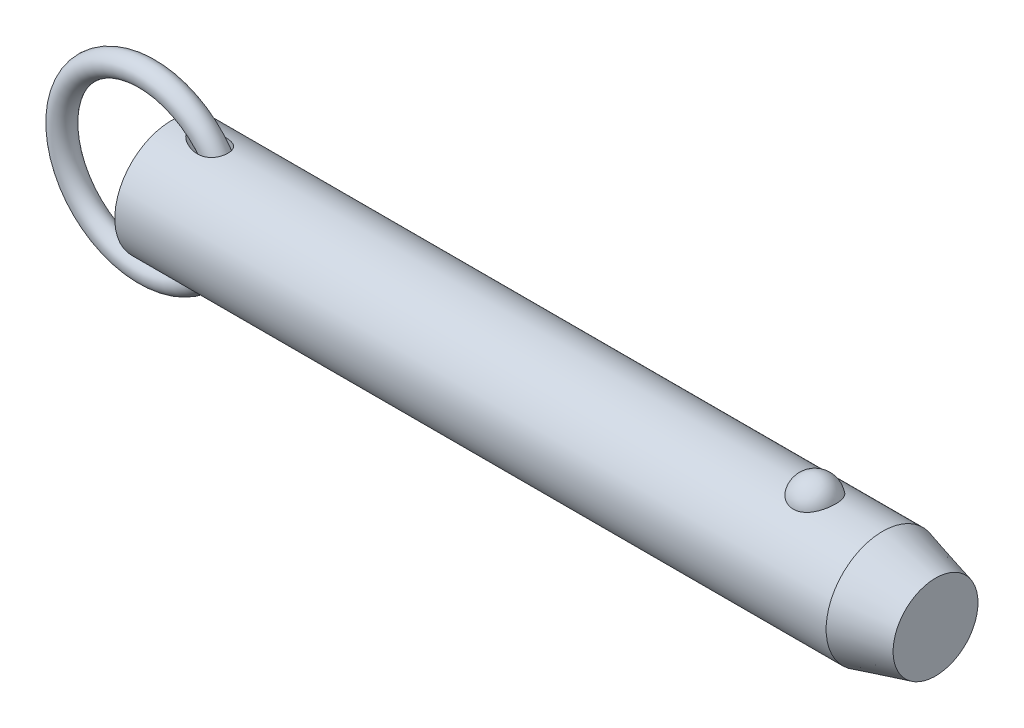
ISO-10303-21;
HEADER;
FILE_DESCRIPTION(('STEP AP214'),'2;1');
FILE_NAME('part.step','',(''),(''),'','','');
FILE_SCHEMA(('AUTOMOTIVE_DESIGN { 1 0 10303 214 1 1 1 1 }'));
ENDSEC;
DATA;
#1=APPLICATION_CONTEXT('core data for automotive mechanical design processes');
#2=APPLICATION_PROTOCOL_DEFINITION('international standard','automotive_design',2000,#1);
#3=PRODUCT_CONTEXT('',#1,'mechanical');
#4=PRODUCT('Part','Part','',(#3));
#5=PRODUCT_RELATED_PRODUCT_CATEGORY('part','',(#4));
#6=PRODUCT_DEFINITION_FORMATION('','',#4);
#7=PRODUCT_DEFINITION_CONTEXT('part definition',#1,'design');
#8=PRODUCT_DEFINITION('design','',#6,#7);
#9=PRODUCT_DEFINITION_SHAPE('','',#8);
#10=(LENGTH_UNIT() NAMED_UNIT(*) SI_UNIT(.MILLI.,.METRE.));
#11=(NAMED_UNIT(*) PLANE_ANGLE_UNIT() SI_UNIT($,.RADIAN.));
#12=(NAMED_UNIT(*) SI_UNIT($,.STERADIAN.) SOLID_ANGLE_UNIT());
#13=UNCERTAINTY_MEASURE_WITH_UNIT(LENGTH_MEASURE(1.E-05),#10,'distance_accuracy_value','');
#14=(GEOMETRIC_REPRESENTATION_CONTEXT(3) GLOBAL_UNCERTAINTY_ASSIGNED_CONTEXT((#13)) GLOBAL_UNIT_ASSIGNED_CONTEXT((#10,
#11,#12)) REPRESENTATION_CONTEXT('',''));
#15=CARTESIAN_POINT('',(0.,0.,0.));
#16=DIRECTION('',(0.,0.,1.));
#17=DIRECTION('',(1.,0.,0.));
#18=AXIS2_PLACEMENT_3D('',#15,#16,#17);
#19=CARTESIAN_POINT('',(-5.53898640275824,0.,0.));
#20=DIRECTION('',(0.,0.,1.));
#21=DIRECTION('',(1.,0.,0.));
#22=AXIS2_PLACEMENT_3D('',#19,#20,#21);
#23=TOROIDAL_SURFACE('',#22,19.05,2.54);
#24=CARTESIAN_POINT('',(16.0510135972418,0.,0.));
#25=VERTEX_POINT('',#24);
#26=VERTEX_LOOP('',#25);
#27=FACE_BOUND('',#26,.T.);
#28=ADVANCED_FACE('P0_F12',(#27),#23,.T.);
#29=CLOSED_SHELL('',(#28));
#30=MANIFOLD_SOLID_BREP('P0_B1',#29);
#31=CARTESIAN_POINT('',(0.,0.,0.));
#32=DIRECTION('',(1.,0.,0.));
#33=DIRECTION('',(0.,0.,-1.));
#34=AXIS2_PLACEMENT_3D('',#31,#32,#33);
#35=CYLINDRICAL_SURFACE('',#34,12.7);
#36=CARTESIAN_POINT('',(159.600738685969,0.,0.));
#37=DIRECTION('',(1.,0.,0.));
#38=DIRECTION('',(0.,0.,-1.));
#39=AXIS2_PLACEMENT_3D('',#36,#37,#38);
#40=CIRCLE('',#39,12.7);
#41=CARTESIAN_POINT('',(159.600738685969,0.,-12.7));
#42=VERTEX_POINT('',#41);
#43=EDGE_CURVE('P1_E89',#42,#42,#40,.T.);
#44=ORIENTED_EDGE('',*,*,#43,.F.);
#45=EDGE_LOOP('',(#44));
#46=FACE_BOUND('',#45,.T.);
#47=CARTESIAN_POINT('',(0.,0.,0.));
#48=DIRECTION('',(1.,0.,0.));
#49=DIRECTION('',(0.,0.,-1.));
#50=AXIS2_PLACEMENT_3D('',#47,#48,#49);
#51=CIRCLE('',#50,12.7);
#52=CARTESIAN_POINT('',(0.,0.,-12.7));
#53=VERTEX_POINT('',#52);
#54=EDGE_CURVE('P1_E52',#53,#53,#51,.T.);
#55=ORIENTED_EDGE('',*,*,#54,.T.);
#56=EDGE_LOOP('',(#55));
#57=FACE_BOUND('',#56,.T.);
#58=CARTESIAN_POINT('',(144.360042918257,11.7500437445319,4.81938502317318));
#59=CARTESIAN_POINT('',(144.235088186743,11.7500430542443,4.81938571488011));
#60=CARTESIAN_POINT('',(144.110144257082,11.7520975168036,4.81438658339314));
#61=CARTESIAN_POINT('',(143.861142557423,11.760253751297,4.79442904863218));
#62=CARTESIAN_POINT('',(143.737085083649,11.7663568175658,4.77946746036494));
#63=CARTESIAN_POINT('',(143.490901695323,11.7824262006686,4.7397141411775));
#64=CARTESIAN_POINT('',(143.368774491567,11.7923898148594,4.71492928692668));
#65=CARTESIAN_POINT('',(143.127187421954,11.8158938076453,4.65571340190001));
#66=CARTESIAN_POINT('',(143.00772859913,11.8294355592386,4.6212786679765));
#67=CARTESIAN_POINT('',(142.772557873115,11.8596812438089,4.54309502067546));
#68=CARTESIAN_POINT('',(142.656839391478,11.8763792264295,4.49936361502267));
#69=CARTESIAN_POINT('',(142.429653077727,11.9124878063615,4.40287235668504));
#70=CARTESIAN_POINT('',(142.318186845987,11.9318994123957,4.35010914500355));
#71=CARTESIAN_POINT('',(141.991278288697,11.9934256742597,4.17881316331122));
#72=CARTESIAN_POINT('',(141.783127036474,12.038858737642,4.04720756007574));
#73=CARTESIAN_POINT('',(141.385850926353,12.1352173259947,3.748564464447));
#74=CARTESIAN_POINT('',(141.197443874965,12.1862630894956,3.58061821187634));
#75=CARTESIAN_POINT('',(140.850521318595,12.2875163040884,3.21600758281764));
#76=CARTESIAN_POINT('',(140.692011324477,12.3377235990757,3.0193379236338));
#77=CARTESIAN_POINT('',(140.40168878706,12.4344923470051,2.592916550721));
#78=CARTESIAN_POINT('',(140.271376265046,12.4807925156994,2.36208286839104));
#79=CARTESIAN_POINT('',(140.049407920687,12.5623454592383,1.88070399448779));
#80=CARTESIAN_POINT('',(139.957755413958,12.5975972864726,1.63015711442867));
#81=CARTESIAN_POINT('',(139.814046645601,12.6538414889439,1.1129886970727));
#82=CARTESIAN_POINT('',(139.762499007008,12.6746503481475,0.846205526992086));
#83=CARTESIAN_POINT('',(139.701977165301,12.699153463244,0.307085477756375));
#84=CARTESIAN_POINT('',(139.693001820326,12.7028481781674,0.034748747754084));
#85=CARTESIAN_POINT('',(139.717731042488,12.6927785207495,-0.506073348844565));
#86=CARTESIAN_POINT('',(139.751189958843,12.6791146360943,-0.774571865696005));
#87=CARTESIAN_POINT('',(139.859687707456,12.635882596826,-1.30170246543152));
#88=CARTESIAN_POINT('',(139.93472729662,12.606314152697,-1.56033436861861));
#89=CARTESIAN_POINT('',(140.12500006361,12.5342328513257,-2.0608389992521));
#90=CARTESIAN_POINT('',(140.240287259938,12.4917026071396,-2.30268867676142));
#91=CARTESIAN_POINT('',(140.508704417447,12.3981123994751,-2.76259600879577));
#92=CARTESIAN_POINT('',(140.661837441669,12.3470517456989,-2.98065173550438));
#93=CARTESIAN_POINT('',(141.003507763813,12.2416045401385,-3.38786328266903));
#94=CARTESIAN_POINT('',(141.192201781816,12.1872040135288,-3.57688418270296));
#95=CARTESIAN_POINT('',(141.600239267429,12.0814086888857,-3.91941073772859));
#96=CARTESIAN_POINT('',(141.819580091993,12.0300136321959,-4.07291945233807));
#97=CARTESIAN_POINT('',(142.278375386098,11.9373542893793,-4.33691289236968));
#98=CARTESIAN_POINT('',(142.517304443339,11.8958982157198,-4.44824125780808));
#99=CARTESIAN_POINT('',(143.01243761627,11.8268116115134,-4.62881985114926));
#100=CARTESIAN_POINT('',(143.268635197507,11.7991758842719,-4.69808589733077));
#101=CARTESIAN_POINT('',(143.777164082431,11.7622209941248,-4.78983181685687));
#102=CARTESIAN_POINT('',(144.029041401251,11.7520502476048,-4.81449025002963));
#103=CARTESIAN_POINT('',(144.533573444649,11.7485796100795,-4.82295735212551));
#104=CARTESIAN_POINT('',(144.786228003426,11.7552763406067,-4.80677420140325));
#105=CARTESIAN_POINT('',(145.276834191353,11.7842584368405,-4.73525430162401));
#106=CARTESIAN_POINT('',(145.514998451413,11.8060486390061,-4.68116061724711));
#107=CARTESIAN_POINT('',(145.978489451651,11.8622750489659,-4.53678133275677));
#108=CARTESIAN_POINT('',(146.203815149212,11.8967122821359,-4.44649279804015));
#109=CARTESIAN_POINT('',(146.640801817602,11.9754603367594,-4.22987613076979));
#110=CARTESIAN_POINT('',(146.852057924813,12.0199699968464,-4.10280539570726));
#111=CARTESIAN_POINT('',(147.250601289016,12.1138028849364,-3.81685409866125));
#112=CARTESIAN_POINT('',(147.437883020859,12.163127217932,-3.65796622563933));
#113=CARTESIAN_POINT('',(147.793350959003,12.2642343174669,-3.30364864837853));
#114=CARTESIAN_POINT('',(147.960111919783,12.3160165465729,-3.10678783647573));
#115=CARTESIAN_POINT('',(148.259579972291,12.4142566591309,-2.68748409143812));
#116=CARTESIAN_POINT('',(148.392280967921,12.4607135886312,-2.4650365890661));
#117=CARTESIAN_POINT('',(148.624691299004,12.5450236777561,-1.9928951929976));
#118=CARTESIAN_POINT('',(148.723215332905,12.5825557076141,-1.74255918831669));
#119=CARTESIAN_POINT('',(148.879227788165,12.6431720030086,-1.2277373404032));
#120=CARTESIAN_POINT('',(148.936715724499,12.6662560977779,-0.96325132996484));
#121=CARTESIAN_POINT('',(149.009544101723,12.6956486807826,-0.4273550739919));
#122=CARTESIAN_POINT('',(149.024837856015,12.7019385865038,-0.155937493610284));
#123=CARTESIAN_POINT('',(149.012779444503,12.6970201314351,0.385928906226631));
#124=CARTESIAN_POINT('',(148.98542805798,12.6858120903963,0.656377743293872));
#125=CARTESIAN_POINT('',(148.913060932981,12.6568455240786,1.05454017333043));
#126=CARTESIAN_POINT('',(148.883796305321,12.6451962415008,1.185778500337));
#127=CARTESIAN_POINT('',(148.815022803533,12.6181819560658,1.44513808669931));
#128=CARTESIAN_POINT('',(148.775517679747,12.6028183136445,1.57326046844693));
#129=CARTESIAN_POINT('',(148.686439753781,12.5687547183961,1.82554978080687));
#130=CARTESIAN_POINT('',(148.636862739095,12.5500533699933,1.9497150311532));
#131=CARTESIAN_POINT('',(148.52792115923,12.5098093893,2.19314370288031));
#132=CARTESIAN_POINT('',(148.468560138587,12.4882677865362,2.31240887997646));
#133=CARTESIAN_POINT('',(148.33997128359,12.4427679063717,2.5459303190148));
#134=CARTESIAN_POINT('',(148.270688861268,12.4187964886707,2.66015396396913));
#135=CARTESIAN_POINT('',(148.122903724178,12.3691892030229,2.88202659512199));
#136=CARTESIAN_POINT('',(148.044404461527,12.3435539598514,2.98967802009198));
#137=CARTESIAN_POINT('',(147.878550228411,12.2912955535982,3.1977438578));
#138=CARTESIAN_POINT('',(147.791191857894,12.2646720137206,3.29815546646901));
#139=CARTESIAN_POINT('',(147.608161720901,12.2111945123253,3.49095035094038));
#140=CARTESIAN_POINT('',(147.512493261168,12.1843406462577,3.58333679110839));
#141=CARTESIAN_POINT('',(147.313627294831,12.1312249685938,3.7592287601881));
#142=CARTESIAN_POINT('',(147.210450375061,12.104961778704,3.84275713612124));
#143=CARTESIAN_POINT('',(146.99701336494,12.0537284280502,4.00056406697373));
#144=CARTESIAN_POINT('',(146.886756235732,12.028757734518,4.07484645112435));
#145=CARTESIAN_POINT('',(146.659755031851,11.9808306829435,4.21367959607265));
#146=CARTESIAN_POINT('',(146.543006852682,11.9578756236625,4.27822410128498));
#147=CARTESIAN_POINT('',(146.30394258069,11.9147184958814,4.39698483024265));
#148=CARTESIAN_POINT('',(146.181628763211,11.894515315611,4.45120522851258));
#149=CARTESIAN_POINT('',(145.922952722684,11.8561129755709,4.55255353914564));
#150=CARTESIAN_POINT('',(145.786223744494,11.8381764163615,4.59884858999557));
#151=CARTESIAN_POINT('',(145.508608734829,11.8069093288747,4.67853897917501));
#152=CARTESIAN_POINT('',(145.367724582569,11.7935767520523,4.71194005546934));
#153=CARTESIAN_POINT('',(145.08309446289,11.7720277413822,4.76552188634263));
#154=CARTESIAN_POINT('',(144.939348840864,11.7638106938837,4.78570422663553));
#155=CARTESIAN_POINT('',(144.650411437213,11.7528195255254,4.81263433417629));
#156=CARTESIAN_POINT('',(144.505219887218,11.7500445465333,4.81938421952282));
#157=CARTESIAN_POINT('',(144.360042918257,11.7500437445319,4.81938502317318));
#158=B_SPLINE_CURVE_WITH_KNOTS('',3,(#58,#59,#60,#61,#62,#63,#64,#65,#66,#67,#68,#69,#70,#71,
#72,#73,#74,#75,#76,#77,#78,#79,#80,#81,#82,#83,#84,#85,#86,#87,#88,#89,#90,#91,#92,#93,#94,#95,
#96,#97,#98,#99,#100,#101,#102,#103,#104,#105,#106,#107,#108,#109,#110,#111,#112,#113,#114,#115,
#116,#117,#118,#119,#120,#121,#122,#123,#124,#125,#126,#127,#128,#129,#130,#131,#132,#133,#134,
#135,#136,#137,#138,#139,#140,#141,#142,#143,#144,#145,#146,#147,#148,#149,#150,#151,#152,#153,
#154,#155,#156,#157),.UNSPECIFIED.,.T.,.F.,(4,2,2,2,2,2,2,2,2,2,2,2,2,2,2,2,2,2,2,2,2,2,2,2,2,2,
2,2,2,2,2,2,2,2,2,2,2,2,2,2,2,2,2,2,2,2,2,2,2,4),(0.,0.374729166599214,0.749578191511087,
1.12416526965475,1.49889629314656,1.87292776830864,2.24709865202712,2.99481328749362,
3.76399449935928,4.53331735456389,5.3368391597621,6.14042986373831,6.95405296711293,
7.76765424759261,8.57656703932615,9.38549455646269,10.1955119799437,11.0055949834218,
11.8193353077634,12.6330054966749,13.4294141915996,14.2255231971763,14.9815786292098,
15.7374826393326,16.4696948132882,17.2019663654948,17.9501979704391,18.6986017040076,
19.4844704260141,20.2704797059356,21.0815215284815,21.8925729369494,22.7045213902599,
23.5164550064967,23.9209608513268,24.3253187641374,24.7298461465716,25.1342272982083,
25.54092555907,25.9474719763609,26.3541750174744,26.7607169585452,27.1661834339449,
27.5714814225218,27.9770386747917,28.3824315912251,28.818120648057,29.2536155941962,
29.6890582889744,30.1244323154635),.UNSPECIFIED.);
#159=CARTESIAN_POINT('',(144.360042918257,11.7500437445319,4.81938502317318));
#160=VERTEX_POINT('',#159);
#161=EDGE_CURVE('P1_E80',#160,#160,#158,.T.);
#162=ORIENTED_EDGE('',*,*,#161,.T.);
#163=EDGE_LOOP('',(#162));
#164=FACE_BOUND('',#163,.T.);
#165=CARTESIAN_POINT('',(-5.53898640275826,0.,0.));
#166=DIRECTION('',(0.796400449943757,-0.604769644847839,0.));
#167=DIRECTION('',(0.604769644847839,0.796400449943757,0.));
#168=AXIS2_PLACEMENT_3D('',#165,#166,#167);
#169=ELLIPSE('',#168,15.9467514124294,12.7);
#170=CARTESIAN_POINT('',(4.09482149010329,12.6864319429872,0.586893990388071));
#171=VERTEX_POINT('',#170);
#172=CARTESIAN_POINT('',(4.09482149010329,12.6864319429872,-0.586893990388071));
#173=VERTEX_POINT('',#172);
#174=EDGE_CURVE('P1_E47',#171,#173,#169,.F.);
#175=ORIENTED_EDGE('',*,*,#174,.T.);
#176=CARTESIAN_POINT('',(4.06153170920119,12.6905758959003,-0.48916605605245));
#177=CARTESIAN_POINT('',(4.0811137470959,12.6881366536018,-0.552489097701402));
#178=CARTESIAN_POINT('',(4.1041785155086,12.6852663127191,-0.614604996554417));
#179=CARTESIAN_POINT('',(4.15628434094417,12.6787965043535,-0.736067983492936));
#180=CARTESIAN_POINT('',(4.18531032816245,12.6751988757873,-0.795421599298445));
#181=CARTESIAN_POINT('',(4.27911159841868,12.6636052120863,-0.967590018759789));
#182=CARTESIAN_POINT('',(4.35123408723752,12.654730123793,-1.07635920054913));
#183=CARTESIAN_POINT('',(4.49106800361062,12.6376715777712,-1.25922957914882));
#184=CARTESIAN_POINT('',(4.55601066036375,12.6297947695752,-1.33556751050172));
#185=CARTESIAN_POINT('',(4.692236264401,12.6134116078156,-1.4823274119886));
#186=CARTESIAN_POINT('',(4.76352147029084,12.6049050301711,-1.55274725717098));
#187=CARTESIAN_POINT('',(4.91163946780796,12.587417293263,-1.68868704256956));
#188=CARTESIAN_POINT('',(4.98851399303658,12.5784327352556,-1.75416062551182));
#189=CARTESIAN_POINT('',(5.14630057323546,12.560235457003,-1.88003275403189));
#190=CARTESIAN_POINT('',(5.22721398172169,12.5510226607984,-1.94042957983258));
#191=CARTESIAN_POINT('',(5.45368877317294,12.5256514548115,-2.09966332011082));
#192=CARTESIAN_POINT('',(5.60261616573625,12.5094182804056,-2.19371988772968));
#193=CARTESIAN_POINT('',(5.90795545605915,12.4774211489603,-2.36893890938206));
#194=CARTESIAN_POINT('',(6.0643723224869,12.4616575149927,-2.45009264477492));
#195=CARTESIAN_POINT('',(6.38306132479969,12.431227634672,-2.6000824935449));
#196=CARTESIAN_POINT('',(6.54533237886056,12.4165611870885,-2.66892086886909));
#197=CARTESIAN_POINT('',(6.87462618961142,12.3889351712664,-2.79435199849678));
#198=CARTESIAN_POINT('',(7.04164773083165,12.3759751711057,-2.85094785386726));
#199=CARTESIAN_POINT('',(7.38726647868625,12.3518460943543,-2.95377962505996));
#200=CARTESIAN_POINT('',(7.56604577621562,12.3407843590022,-2.99943209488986));
#201=CARTESIAN_POINT('',(7.92698692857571,12.3219309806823,-3.07596683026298));
#202=CARTESIAN_POINT('',(8.10914972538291,12.314140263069,-3.10684491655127));
#203=CARTESIAN_POINT('',(8.47511457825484,12.3025918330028,-3.15226850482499));
#204=CARTESIAN_POINT('',(8.6589097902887,12.2988216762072,-3.16686440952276));
#205=CARTESIAN_POINT('',(9.02696087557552,12.2959421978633,-3.17802250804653));
#206=CARTESIAN_POINT('',(9.21121628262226,12.2968292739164,-3.17459864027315));
#207=CARTESIAN_POINT('',(9.61636263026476,12.3045198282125,-3.14471110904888));
#208=CARTESIAN_POINT('',(9.83695552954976,12.3125080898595,-3.11363232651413));
#209=CARTESIAN_POINT('',(10.1619126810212,12.3303028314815,-3.04206574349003));
#210=CARTESIAN_POINT('',(10.2692747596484,12.3372061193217,-3.01403983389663));
#211=CARTESIAN_POINT('',(10.4811758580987,12.3528538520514,-2.94925947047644));
#212=CARTESIAN_POINT('',(10.5857162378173,12.361597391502,-2.91250930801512));
#213=CARTESIAN_POINT('',(10.792132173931,12.3808585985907,-2.8295174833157));
#214=CARTESIAN_POINT('',(10.8939665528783,12.3913944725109,-2.78317723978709));
#215=CARTESIAN_POINT('',(11.092611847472,12.4138762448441,-2.68112002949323));
#216=CARTESIAN_POINT('',(11.1894254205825,12.4258213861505,-2.62540809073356));
#217=CARTESIAN_POINT('',(11.3768740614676,12.4507225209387,-2.50465655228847));
#218=CARTESIAN_POINT('',(11.4675115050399,12.4636781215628,-2.43962056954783));
#219=CARTESIAN_POINT('',(11.6414572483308,12.4901070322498,-2.30048560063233));
#220=CARTESIAN_POINT('',(11.7247669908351,12.5035802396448,-2.22638840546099));
#221=CARTESIAN_POINT('',(11.8713131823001,12.5285000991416,-2.08117367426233));
#222=CARTESIAN_POINT('',(11.9357009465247,12.5399538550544,-2.01121596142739));
#223=CARTESIAN_POINT('',(12.0576805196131,12.5624496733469,-1.86555293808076));
#224=CARTESIAN_POINT('',(12.1152732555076,12.5734917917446,-1.7898484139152));
#225=CARTESIAN_POINT('',(12.223073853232,12.5947858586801,-1.63327883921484));
#226=CARTESIAN_POINT('',(12.2732844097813,12.6050380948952,-1.5524156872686));
#227=CARTESIAN_POINT('',(12.3658430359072,12.6243983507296,-1.38621267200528));
#228=CARTESIAN_POINT('',(12.408191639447,12.6335064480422,-1.30087311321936));
#229=CARTESIAN_POINT('',(12.5150098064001,12.6569076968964,-1.05702619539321));
#230=CARTESIAN_POINT('',(12.5703399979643,12.6695746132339,-0.894232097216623));
#231=CARTESIAN_POINT('',(12.6526225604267,12.6886816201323,-0.561391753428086));
#232=CARTESIAN_POINT('',(12.6795825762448,12.6951233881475,-0.391347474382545));
#233=CARTESIAN_POINT('',(12.7041016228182,12.7009766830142,-0.0537636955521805));
#234=CARTESIAN_POINT('',(12.7024538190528,12.7005778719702,0.113714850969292));
#235=CARTESIAN_POINT('',(12.6717240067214,12.6932548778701,0.445979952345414));
#236=CARTESIAN_POINT('',(12.6426435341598,12.6863310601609,0.610766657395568));
#237=CARTESIAN_POINT('',(12.5579769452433,12.6667465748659,0.932429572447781));
#238=CARTESIAN_POINT('',(12.5024793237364,12.6541050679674,1.08933027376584));
#239=CARTESIAN_POINT('',(12.3665691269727,12.6244558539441,1.39146752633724));
#240=CARTESIAN_POINT('',(12.2861577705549,12.6074483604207,1.53670464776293));
#241=CARTESIAN_POINT('',(12.1018203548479,12.5706804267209,1.81319588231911));
#242=CARTESIAN_POINT('',(11.9976588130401,12.5508932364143,1.94428915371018));
#243=CARTESIAN_POINT('',(11.7695265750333,12.5107540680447,2.18776051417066));
#244=CARTESIAN_POINT('',(11.6455540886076,12.4904020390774,2.3001369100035));
#245=CARTESIAN_POINT('',(11.3759347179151,12.4502278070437,2.50870972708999));
#246=CARTESIAN_POINT('',(11.2295880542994,12.4304654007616,2.60400962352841));
#247=CARTESIAN_POINT('',(10.9239803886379,12.3941696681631,2.77162929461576));
#248=CARTESIAN_POINT('',(10.7647152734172,12.3776373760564,2.84394171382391));
#249=CARTESIAN_POINT('',(10.4192039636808,12.3473062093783,2.97303525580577));
#250=CARTESIAN_POINT('',(10.2319332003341,12.3340204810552,3.027171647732));
#251=CARTESIAN_POINT('',(9.85152982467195,12.3134301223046,3.10986173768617));
#252=CARTESIAN_POINT('',(9.65839336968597,12.3061295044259,3.13839827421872));
#253=CARTESIAN_POINT('',(9.31022514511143,12.2982822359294,3.16897517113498));
#254=CARTESIAN_POINT('',(9.15555718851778,12.2966525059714,3.17526894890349));
#255=CARTESIAN_POINT('',(8.84618945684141,12.2967963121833,3.17471335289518));
#256=CARTESIAN_POINT('',(8.6914897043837,12.2985715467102,3.16785742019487));
#257=CARTESIAN_POINT('',(8.38280471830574,12.3051648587,3.14214692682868));
#258=CARTESIAN_POINT('',(8.22882218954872,12.3099904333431,3.12326280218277));
#259=CARTESIAN_POINT('',(7.92276070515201,12.3222644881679,3.07448013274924));
#260=CARTESIAN_POINT('',(7.77068148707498,12.3297126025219,3.04458312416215));
#261=CARTESIAN_POINT('',(7.46452663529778,12.3470493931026,2.97350781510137));
#262=CARTESIAN_POINT('',(7.31052714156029,12.3570043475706,2.93201910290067));
#263=CARTESIAN_POINT('',(7.00579083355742,12.3787609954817,2.83876185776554));
#264=CARTESIAN_POINT('',(6.85505451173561,12.3905629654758,2.7869917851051));
#265=CARTESIAN_POINT('',(6.55781208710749,12.415528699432,2.67357744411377));
#266=CARTESIAN_POINT('',(6.41129783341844,12.4286895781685,2.61195394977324));
#267=CARTESIAN_POINT('',(6.12302950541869,12.4559398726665,2.47874512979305));
#268=CARTESIAN_POINT('',(5.98127390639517,12.4700289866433,2.40716303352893));
#269=CARTESIAN_POINT('',(5.67073126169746,12.5020754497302,2.23550426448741));
#270=CARTESIAN_POINT('',(5.50343839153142,12.5201625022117,2.13268685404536));
#271=CARTESIAN_POINT('',(5.26147616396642,12.5471537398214,1.96522579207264));
#272=CARTESIAN_POINT('',(5.18224299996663,12.5561365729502,1.90713440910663));
#273=CARTESIAN_POINT('',(5.0274647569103,12.5739122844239,1.78618989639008));
#274=CARTESIAN_POINT('',(4.95191912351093,12.5827051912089,1.72333748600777));
#275=CARTESIAN_POINT('',(4.81787163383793,12.598469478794,1.60360864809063));
#276=CARTESIAN_POINT('',(4.75865966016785,12.6054958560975,1.54753994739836));
#277=CARTESIAN_POINT('',(4.64406285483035,12.6191906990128,1.43158546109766));
#278=CARTESIAN_POINT('',(4.58867926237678,12.6258590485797,1.37169845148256));
#279=CARTESIAN_POINT('',(4.43014912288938,12.6450546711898,1.18656670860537));
#280=CARTESIAN_POINT('',(4.33372726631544,12.6568788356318,1.05507993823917));
#281=CARTESIAN_POINT('',(4.21252055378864,12.6718304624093,0.848052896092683));
#282=CARTESIAN_POINT('',(4.17660155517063,12.6762773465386,0.779100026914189));
#283=CARTESIAN_POINT('',(4.11264979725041,12.6842122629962,0.637080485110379));
#284=CARTESIAN_POINT('',(4.08466792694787,12.6876941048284,0.563990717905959));
#285=CARTESIAN_POINT('',(4.06153170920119,12.6905758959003,0.489166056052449));
#286=B_SPLINE_CURVE_WITH_KNOTS('',3,(#176,#177,#178,#179,#180,#181,#182,#183,#184,#185,#186,
#187,#188,#189,#190,#191,#192,#193,#194,#195,#196,#197,#198,#199,#200,#201,#202,#203,#204,#205,
#206,#207,#208,#209,#210,#211,#212,#213,#214,#215,#216,#217,#218,#219,#220,#221,#222,#223,#224,
#225,#226,#227,#228,#229,#230,#231,#232,#233,#234,#235,#236,#237,#238,#239,#240,#241,#242,#243,
#244,#245,#246,#247,#248,#249,#250,#251,#252,#253,#254,#255,#256,#257,#258,#259,#260,#261,#262,
#263,#264,#265,#266,#267,#268,#269,#270,#271,#272,#273,#274,#275,#276,#277,#278,#279,#280,#281,
#282,#283,#284,#285),.UNSPECIFIED.,.F.,.F.,(4,2,2,2,2,2,2,2,2,2,2,2,2,2,2,2,2,2,2,2,2,2,2,2,2,2,
2,2,2,2,2,2,2,2,2,2,2,2,2,2,2,2,2,2,2,2,2,2,2,2,2,2,2,2,4),(0.,0.198708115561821,
0.39691995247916,0.787580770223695,1.08882492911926,1.3901767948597,1.69407136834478,
1.9980684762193,2.52793143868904,3.05815092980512,3.58827293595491,4.1182605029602,
4.67218806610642,5.22627222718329,5.77863637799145,6.33057333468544,6.99657211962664,
7.32977411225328,7.66281254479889,7.99946156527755,8.33593054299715,8.6722693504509,
9.00854178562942,9.29544181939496,9.58230266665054,9.8690585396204,10.155794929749,
10.670233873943,11.184534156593,11.6845985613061,12.1846349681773,12.6830079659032,
13.1813565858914,13.6848795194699,14.1884479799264,14.7135333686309,15.2387866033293,
15.8228373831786,16.4072794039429,16.8710810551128,17.3351141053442,17.8002921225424,
18.2654052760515,18.7444169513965,19.2235004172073,19.7015868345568,20.1795185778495,
20.7699825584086,21.0658110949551,21.361595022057,21.6069574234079,21.8523988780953,
22.3397467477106,22.5729183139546,22.8075527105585),.UNSPECIFIED.);
#287=EDGE_CURVE('P1_E51',#173,#171,#286,.T.);
#288=ORIENTED_EDGE('',*,*,#287,.T.);
#289=EDGE_LOOP('',(#175,#288));
#290=FACE_BOUND('',#289,.T.);
#291=CARTESIAN_POINT('',(-5.53898640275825,0.,0.));
#292=DIRECTION('',(-0.796400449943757,-0.604769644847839,0.));
#293=DIRECTION('',(0.604769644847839,-0.796400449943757,0.));
#294=AXIS2_PLACEMENT_3D('',#291,#292,#293);
#295=ELLIPSE('',#294,15.9467514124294,12.7);
#296=CARTESIAN_POINT('',(4.0948214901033,-12.6864319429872,0.586893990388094));
#297=VERTEX_POINT('',#296);
#298=CARTESIAN_POINT('',(4.0948214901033,-12.6864319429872,-0.586893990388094));
#299=VERTEX_POINT('',#298);
#300=EDGE_CURVE('P1_E28',#297,#299,#295,.F.);
#301=ORIENTED_EDGE('',*,*,#300,.F.);
#302=CARTESIAN_POINT('',(4.06153170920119,-12.6905758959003,0.489166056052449));
#303=CARTESIAN_POINT('',(4.08111374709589,-12.6881366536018,0.552489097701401));
#304=CARTESIAN_POINT('',(4.1041785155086,-12.6852663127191,0.614604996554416));
#305=CARTESIAN_POINT('',(4.15628434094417,-12.6787965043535,0.736067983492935));
#306=CARTESIAN_POINT('',(4.18531032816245,-12.6751988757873,0.795421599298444));
#307=CARTESIAN_POINT('',(4.27911159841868,-12.6636052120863,0.967590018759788));
#308=CARTESIAN_POINT('',(4.35123408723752,-12.654730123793,1.07635920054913));
#309=CARTESIAN_POINT('',(4.49106800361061,-12.6376715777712,1.25922957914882));
#310=CARTESIAN_POINT('',(4.55601066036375,-12.6297947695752,1.33556751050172));
#311=CARTESIAN_POINT('',(4.692236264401,-12.6134116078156,1.48232741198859));
#312=CARTESIAN_POINT('',(4.76352147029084,-12.6049050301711,1.55274725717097));
#313=CARTESIAN_POINT('',(4.91163946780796,-12.587417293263,1.68868704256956));
#314=CARTESIAN_POINT('',(4.98851399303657,-12.5784327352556,1.75416062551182));
#315=CARTESIAN_POINT('',(5.14630057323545,-12.560235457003,1.88003275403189));
#316=CARTESIAN_POINT('',(5.22721398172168,-12.5510226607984,1.94042957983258));
#317=CARTESIAN_POINT('',(5.45368877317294,-12.5256514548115,2.09966332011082));
#318=CARTESIAN_POINT('',(5.60261616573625,-12.5094182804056,2.19371988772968));
#319=CARTESIAN_POINT('',(5.90795545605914,-12.4774211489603,2.36893890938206));
#320=CARTESIAN_POINT('',(6.06437232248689,-12.4616575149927,2.45009264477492));
#321=CARTESIAN_POINT('',(6.38306132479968,-12.431227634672,2.6000824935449));
#322=CARTESIAN_POINT('',(6.54533237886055,-12.4165611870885,2.66892086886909));
#323=CARTESIAN_POINT('',(6.87462618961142,-12.3889351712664,2.79435199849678));
#324=CARTESIAN_POINT('',(7.04164773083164,-12.3759751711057,2.85094785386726));
#325=CARTESIAN_POINT('',(7.38726647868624,-12.3518460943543,2.95377962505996));
#326=CARTESIAN_POINT('',(7.56604577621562,-12.3407843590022,2.99943209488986));
#327=CARTESIAN_POINT('',(7.92698692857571,-12.3219309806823,3.07596683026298));
#328=CARTESIAN_POINT('',(8.1091497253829,-12.314140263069,3.10684491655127));
#329=CARTESIAN_POINT('',(8.47511457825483,-12.3025918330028,3.15226850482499));
#330=CARTESIAN_POINT('',(8.65890979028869,-12.2988216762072,3.16686440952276));
#331=CARTESIAN_POINT('',(9.02696087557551,-12.2959421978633,3.17802250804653));
#332=CARTESIAN_POINT('',(9.21121628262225,-12.2968292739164,3.17459864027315));
#333=CARTESIAN_POINT('',(9.61636263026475,-12.3045198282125,3.14471110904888));
#334=CARTESIAN_POINT('',(9.83695552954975,-12.3125080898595,3.11363232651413));
#335=CARTESIAN_POINT('',(10.1619126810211,-12.3303028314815,3.04206574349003));
#336=CARTESIAN_POINT('',(10.2692747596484,-12.3372061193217,3.01403983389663));
#337=CARTESIAN_POINT('',(10.4811758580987,-12.3528538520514,2.94925947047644));
#338=CARTESIAN_POINT('',(10.5857162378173,-12.361597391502,2.91250930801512));
#339=CARTESIAN_POINT('',(10.792132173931,-12.3808585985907,2.8295174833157));
#340=CARTESIAN_POINT('',(10.8939665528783,-12.3913944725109,2.78317723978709));
#341=CARTESIAN_POINT('',(11.092611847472,-12.4138762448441,2.68112002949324));
#342=CARTESIAN_POINT('',(11.1894254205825,-12.4258213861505,2.62540809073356));
#343=CARTESIAN_POINT('',(11.3768740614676,-12.4507225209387,2.50465655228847));
#344=CARTESIAN_POINT('',(11.4675115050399,-12.4636781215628,2.43962056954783));
#345=CARTESIAN_POINT('',(11.6414572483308,-12.4901070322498,2.30048560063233));
#346=CARTESIAN_POINT('',(11.7247669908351,-12.5035802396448,2.22638840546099));
#347=CARTESIAN_POINT('',(11.8713131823,-12.5285000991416,2.08117367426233));
#348=CARTESIAN_POINT('',(11.9357009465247,-12.5399538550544,2.01121596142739));
#349=CARTESIAN_POINT('',(12.0576805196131,-12.5624496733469,1.86555293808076));
#350=CARTESIAN_POINT('',(12.1152732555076,-12.5734917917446,1.7898484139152));
#351=CARTESIAN_POINT('',(12.223073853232,-12.5947858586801,1.63327883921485));
#352=CARTESIAN_POINT('',(12.2732844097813,-12.6050380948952,1.5524156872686));
#353=CARTESIAN_POINT('',(12.3658430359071,-12.6243983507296,1.38621267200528));
#354=CARTESIAN_POINT('',(12.408191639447,-12.6335064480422,1.30087311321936));
#355=CARTESIAN_POINT('',(12.5150098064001,-12.6569076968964,1.05702619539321));
#356=CARTESIAN_POINT('',(12.5703399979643,-12.6695746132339,0.894232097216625));
#357=CARTESIAN_POINT('',(12.6526225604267,-12.6886816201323,0.56139175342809));
#358=CARTESIAN_POINT('',(12.6795825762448,-12.6951233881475,0.39134747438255));
#359=CARTESIAN_POINT('',(12.7041016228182,-12.7009766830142,0.0537636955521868));
#360=CARTESIAN_POINT('',(12.7024538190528,-12.7005778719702,-0.113714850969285));
#361=CARTESIAN_POINT('',(12.6717240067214,-12.6932548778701,-0.445979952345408));
#362=CARTESIAN_POINT('',(12.6426435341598,-12.6863310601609,-0.610766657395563));
#363=CARTESIAN_POINT('',(12.5579769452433,-12.6667465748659,-0.932429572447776));
#364=CARTESIAN_POINT('',(12.5024793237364,-12.6541050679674,-1.08933027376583));
#365=CARTESIAN_POINT('',(12.3665691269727,-12.6244558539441,-1.39146752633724));
#366=CARTESIAN_POINT('',(12.2861577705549,-12.6074483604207,-1.53670464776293));
#367=CARTESIAN_POINT('',(12.1018203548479,-12.5706804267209,-1.81319588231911));
#368=CARTESIAN_POINT('',(11.9976588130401,-12.5508932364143,-1.94428915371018));
#369=CARTESIAN_POINT('',(11.7695265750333,-12.5107540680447,-2.18776051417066));
#370=CARTESIAN_POINT('',(11.6455540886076,-12.4904020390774,-2.3001369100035));
#371=CARTESIAN_POINT('',(11.3759347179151,-12.4502278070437,-2.50870972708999));
#372=CARTESIAN_POINT('',(11.2295880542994,-12.4304654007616,-2.60400962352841));
#373=CARTESIAN_POINT('',(10.9239803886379,-12.3941696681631,-2.77162929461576));
#374=CARTESIAN_POINT('',(10.7647152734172,-12.3776373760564,-2.84394171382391));
#375=CARTESIAN_POINT('',(10.4192039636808,-12.3473062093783,-2.97303525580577));
#376=CARTESIAN_POINT('',(10.2319332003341,-12.3340204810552,-3.027171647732));
#377=CARTESIAN_POINT('',(9.85152982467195,-12.3134301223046,-3.10986173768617));
#378=CARTESIAN_POINT('',(9.65839336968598,-12.3061295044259,-3.13839827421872));
#379=CARTESIAN_POINT('',(9.31022514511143,-12.2982822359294,-3.16897517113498));
#380=CARTESIAN_POINT('',(9.15555718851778,-12.2966525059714,-3.17526894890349));
#381=CARTESIAN_POINT('',(8.84618945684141,-12.2967963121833,-3.17471335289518));
#382=CARTESIAN_POINT('',(8.6914897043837,-12.2985715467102,-3.16785742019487));
#383=CARTESIAN_POINT('',(8.38280471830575,-12.3051648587,-3.14214692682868));
#384=CARTESIAN_POINT('',(8.22882218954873,-12.3099904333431,-3.12326280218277));
#385=CARTESIAN_POINT('',(7.92276070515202,-12.3222644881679,-3.07448013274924));
#386=CARTESIAN_POINT('',(7.77068148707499,-12.3297126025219,-3.04458312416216));
#387=CARTESIAN_POINT('',(7.46452663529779,-12.3470493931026,-2.97350781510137));
#388=CARTESIAN_POINT('',(7.3105271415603,-12.3570043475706,-2.93201910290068));
#389=CARTESIAN_POINT('',(7.00579083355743,-12.3787609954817,-2.83876185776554));
#390=CARTESIAN_POINT('',(6.85505451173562,-12.3905629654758,-2.78699178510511));
#391=CARTESIAN_POINT('',(6.5578120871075,-12.415528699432,-2.67357744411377));
#392=CARTESIAN_POINT('',(6.41129783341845,-12.4286895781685,-2.61195394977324));
#393=CARTESIAN_POINT('',(6.12302950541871,-12.4559398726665,-2.47874512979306));
#394=CARTESIAN_POINT('',(5.98127390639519,-12.4700289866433,-2.40716303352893));
#395=CARTESIAN_POINT('',(5.67073126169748,-12.5020754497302,-2.23550426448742));
#396=CARTESIAN_POINT('',(5.50343839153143,-12.5201625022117,-2.13268685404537));
#397=CARTESIAN_POINT('',(5.26147616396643,-12.5471537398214,-1.96522579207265));
#398=CARTESIAN_POINT('',(5.18224299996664,-12.5561365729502,-1.90713440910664));
#399=CARTESIAN_POINT('',(5.02746475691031,-12.5739122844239,-1.78618989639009));
#400=CARTESIAN_POINT('',(4.95191912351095,-12.5827051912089,-1.72333748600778));
#401=CARTESIAN_POINT('',(4.81787163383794,-12.598469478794,-1.60360864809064));
#402=CARTESIAN_POINT('',(4.75865966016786,-12.6054958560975,-1.54753994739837));
#403=CARTESIAN_POINT('',(4.64406285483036,-12.6191906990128,-1.43158546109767));
#404=CARTESIAN_POINT('',(4.58867926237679,-12.6258590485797,-1.37169845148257));
#405=CARTESIAN_POINT('',(4.43014912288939,-12.6450546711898,-1.18656670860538));
#406=CARTESIAN_POINT('',(4.33372726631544,-12.6568788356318,-1.05507993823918));
#407=CARTESIAN_POINT('',(4.21252055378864,-12.6718304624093,-0.848052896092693));
#408=CARTESIAN_POINT('',(4.17660155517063,-12.6762773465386,-0.779100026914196));
#409=CARTESIAN_POINT('',(4.11264979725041,-12.6842122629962,-0.637080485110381));
#410=CARTESIAN_POINT('',(4.08466792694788,-12.6876941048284,-0.563990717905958));
#411=CARTESIAN_POINT('',(4.0615317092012,-12.6905758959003,-0.489166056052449));
#412=B_SPLINE_CURVE_WITH_KNOTS('',3,(#302,#303,#304,#305,#306,#307,#308,#309,#310,#311,#312,
#313,#314,#315,#316,#317,#318,#319,#320,#321,#322,#323,#324,#325,#326,#327,#328,#329,#330,#331,
#332,#333,#334,#335,#336,#337,#338,#339,#340,#341,#342,#343,#344,#345,#346,#347,#348,#349,#350,
#351,#352,#353,#354,#355,#356,#357,#358,#359,#360,#361,#362,#363,#364,#365,#366,#367,#368,#369,
#370,#371,#372,#373,#374,#375,#376,#377,#378,#379,#380,#381,#382,#383,#384,#385,#386,#387,#388,
#389,#390,#391,#392,#393,#394,#395,#396,#397,#398,#399,#400,#401,#402,#403,#404,#405,#406,#407,
#408,#409,#410,#411),.UNSPECIFIED.,.F.,.F.,(4,2,2,2,2,2,2,2,2,2,2,2,2,2,2,2,2,2,2,2,2,2,2,2,2,2,
2,2,2,2,2,2,2,2,2,2,2,2,2,2,2,2,2,2,2,2,2,2,2,2,2,2,2,2,4),(0.,0.198708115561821,
0.39691995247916,0.787580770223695,1.08882492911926,1.3901767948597,1.69407136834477,
1.9980684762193,2.52793143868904,3.05815092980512,3.5882729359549,4.1182605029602,
4.67218806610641,5.22627222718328,5.77863637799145,6.33057333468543,6.99657211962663,
7.32977411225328,7.66281254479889,7.99946156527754,8.33593054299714,8.6722693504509,
9.00854178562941,9.29544181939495,9.58230266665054,9.8690585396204,10.155794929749,
10.670233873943,11.184534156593,11.6845985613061,12.1846349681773,12.6830079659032,
13.1813565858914,13.6848795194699,14.1884479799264,14.7135333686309,15.2387866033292,
15.8228373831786,16.4072794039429,16.8710810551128,17.3351141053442,17.8002921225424,
18.2654052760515,18.7444169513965,19.2235004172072,19.7015868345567,20.1795185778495,
20.7699825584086,21.0658110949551,21.361595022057,21.6069574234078,21.8523988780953,
22.3397467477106,22.5729183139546,22.8075527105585),.UNSPECIFIED.);
#413=EDGE_CURVE('P1_E10',#297,#299,#412,.T.);
#414=ORIENTED_EDGE('',*,*,#413,.T.);
#415=EDGE_LOOP('',(#301,#414));
#416=FACE_BOUND('',#415,.T.);
#417=ADVANCED_FACE('P1_F15',(#46,#57,#164,#290,#416),#35,.T.);
#418=CARTESIAN_POINT('',(0.,0.,0.));
#419=DIRECTION('',(-1.,0.,0.));
#420=DIRECTION('',(0.,0.,1.));
#421=AXIS2_PLACEMENT_3D('',#418,#419,#420);
#422=PLANE('',#421);
#423=ORIENTED_EDGE('',*,*,#54,.F.);
#424=EDGE_LOOP('',(#423));
#425=FACE_BOUND('',#424,.T.);
#426=ADVANCED_FACE('P1_F17',(#425),#422,.T.);
#427=CARTESIAN_POINT('',(171.45,0.,0.));
#428=DIRECTION('',(-1.,0.,0.));
#429=DIRECTION('',(0.,0.,1.));
#430=AXIS2_PLACEMENT_3D('',#427,#428,#429);
#431=CONICAL_SURFACE('',#430,9.52500000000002,0.26179938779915);
#432=ORIENTED_EDGE('',*,*,#43,.T.);
#433=EDGE_LOOP('',(#432));
#434=FACE_BOUND('',#433,.T.);
#435=CARTESIAN_POINT('',(171.45,0.,0.));
#436=DIRECTION('',(1.,0.,0.));
#437=DIRECTION('',(0.,0.,-1.));
#438=AXIS2_PLACEMENT_3D('',#435,#436,#437);
#439=CIRCLE('',#438,9.52500000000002);
#440=CARTESIAN_POINT('',(171.45,0.,-9.52500000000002));
#441=VERTEX_POINT('',#440);
#442=EDGE_CURVE('P1_E86',#441,#441,#439,.T.);
#443=ORIENTED_EDGE('',*,*,#442,.F.);
#444=EDGE_LOOP('',(#443));
#445=FACE_BOUND('',#444,.T.);
#446=ADVANCED_FACE('P1_F105',(#434,#445),#431,.T.);
#447=CARTESIAN_POINT('',(171.45,9.52500000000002,0.));
#448=DIRECTION('',(1.,0.,0.));
#449=DIRECTION('',(0.,0.,-1.));
#450=AXIS2_PLACEMENT_3D('',#447,#448,#449);
#451=PLANE('',#450);
#452=ORIENTED_EDGE('',*,*,#442,.T.);
#453=EDGE_LOOP('',(#452));
#454=FACE_BOUND('',#453,.T.);
#455=ADVANCED_FACE('P1_F78',(#454),#451,.T.);
#456=CARTESIAN_POINT('',(144.360042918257,11.43,0.));
#457=DIRECTION('',(-1.,0.,0.));
#458=DIRECTION('',(0.,1.,0.));
#459=AXIS2_PLACEMENT_3D('',#456,#457,#458);
#460=SPHERICAL_SURFACE('',#459,4.83);
#461=ORIENTED_EDGE('',*,*,#161,.F.);
#462=EDGE_LOOP('',(#461));
#463=FACE_BOUND('',#462,.T.);
#464=ADVANCED_FACE('P1_F71',(#463),#460,.T.);
#465=CARTESIAN_POINT('',(-5.53898640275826,0.,0.));
#466=DIRECTION('',(0.,0.,1.));
#467=DIRECTION('',(1.,0.,0.));
#468=AXIS2_PLACEMENT_3D('',#465,#466,#467);
#469=TOROIDAL_SURFACE('',#468,19.05,3.175);
#470=CARTESIAN_POINT('',(5.98187533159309,-15.1714285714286,0.));
#471=DIRECTION('',(-0.796400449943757,-0.604769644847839,0.));
#472=DIRECTION('',(0.604769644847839,-0.796400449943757,0.));
#473=AXIS2_PLACEMENT_3D('',#470,#471,#472);
#474=CIRCLE('',#473,3.175);
#475=EDGE_CURVE('P1_E34',#297,#299,#474,.T.);
#476=ORIENTED_EDGE('',*,*,#475,.T.);
#477=ORIENTED_EDGE('',*,*,#413,.F.);
#478=EDGE_LOOP('',(#476,#477));
#479=FACE_BOUND('',#478,.T.);
#480=CARTESIAN_POINT('',(5.98187533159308,15.1714285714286,0.));
#481=DIRECTION('',(0.796400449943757,-0.604769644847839,0.));
#482=DIRECTION('',(0.604769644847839,0.796400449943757,0.));
#483=AXIS2_PLACEMENT_3D('',#480,#481,#482);
#484=CIRCLE('',#483,3.175);
#485=EDGE_CURVE('P1_E41',#171,#173,#484,.T.);
#486=ORIENTED_EDGE('',*,*,#485,.F.);
#487=ORIENTED_EDGE('',*,*,#287,.F.);
#488=EDGE_LOOP('',(#486,#487));
#489=FACE_BOUND('',#488,.T.);
#490=ADVANCED_FACE('P1_F55',(#479,#489),#469,.F.);
#491=CARTESIAN_POINT('',(5.98187533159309,-15.1714285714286,0.));
#492=DIRECTION('',(-0.796400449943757,-0.604769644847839,0.));
#493=DIRECTION('',(0.604769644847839,-0.796400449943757,0.));
#494=AXIS2_PLACEMENT_3D('',#491,#492,#493);
#495=PLANE('',#494);
#496=ORIENTED_EDGE('',*,*,#300,.T.);
#497=ORIENTED_EDGE('',*,*,#475,.F.);
#498=EDGE_LOOP('',(#496,#497));
#499=FACE_BOUND('',#498,.T.);
#500=ADVANCED_FACE('P1_F70',(#499),#495,.F.);
#501=CARTESIAN_POINT('',(5.98187533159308,15.1714285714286,0.));
#502=DIRECTION('',(0.796400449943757,-0.604769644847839,0.));
#503=DIRECTION('',(0.604769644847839,0.796400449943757,0.));
#504=AXIS2_PLACEMENT_3D('',#501,#502,#503);
#505=PLANE('',#504);
#506=ORIENTED_EDGE('',*,*,#485,.T.);
#507=ORIENTED_EDGE('',*,*,#174,.F.);
#508=EDGE_LOOP('',(#506,#507));
#509=FACE_BOUND('',#508,.T.);
#510=ADVANCED_FACE('P1_F48',(#509),#505,.T.);
#511=CLOSED_SHELL('',(#417,#426,#446,#455,#464,#490,#500,#510));
#512=MANIFOLD_SOLID_BREP('P1_B1',#511);
#513=ADVANCED_BREP_SHAPE_REPRESENTATION('',(#18,#30,#512),#14);
#514=SHAPE_DEFINITION_REPRESENTATION(#9,#513);
ENDSEC;
END-ISO-10303-21;
